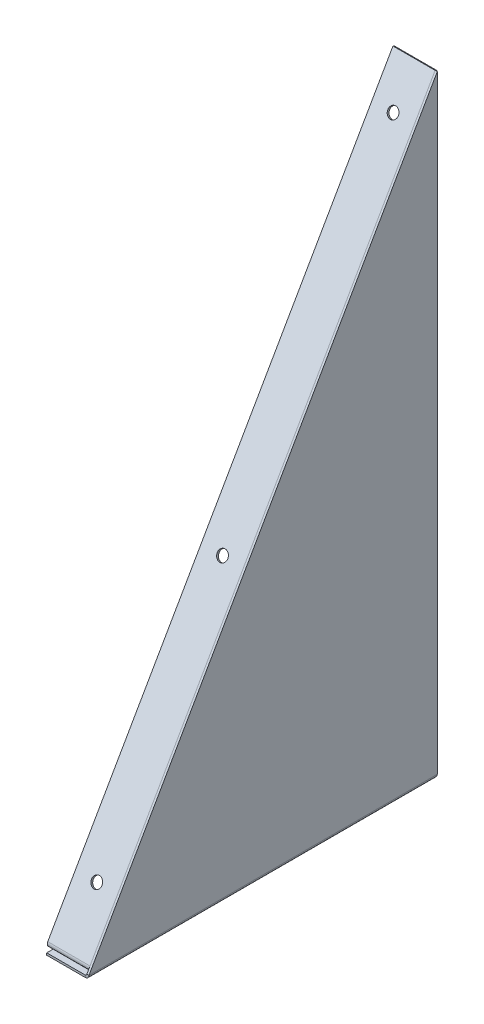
ISO-10303-21;
HEADER;
FILE_DESCRIPTION(('STEP AP214'),'2;1');
FILE_NAME('part.step','',(''),(''),'','','');
FILE_SCHEMA(('AUTOMOTIVE_DESIGN { 1 0 10303 214 1 1 1 1 }'));
ENDSEC;
DATA;
#1=APPLICATION_CONTEXT('core data for automotive mechanical design processes');
#2=APPLICATION_PROTOCOL_DEFINITION('international standard','automotive_design',2000,#1);
#3=PRODUCT_CONTEXT('',#1,'mechanical');
#4=PRODUCT('Part','Part','',(#3));
#5=PRODUCT_RELATED_PRODUCT_CATEGORY('part','',(#4));
#6=PRODUCT_DEFINITION_FORMATION('','',#4);
#7=PRODUCT_DEFINITION_CONTEXT('part definition',#1,'design');
#8=PRODUCT_DEFINITION('design','',#6,#7);
#9=PRODUCT_DEFINITION_SHAPE('','',#8);
#10=(LENGTH_UNIT() NAMED_UNIT(*) SI_UNIT(.MILLI.,.METRE.));
#11=(NAMED_UNIT(*) PLANE_ANGLE_UNIT() SI_UNIT($,.RADIAN.));
#12=(NAMED_UNIT(*) SI_UNIT($,.STERADIAN.) SOLID_ANGLE_UNIT());
#13=UNCERTAINTY_MEASURE_WITH_UNIT(LENGTH_MEASURE(1.E-05),#10,'distance_accuracy_value','');
#14=(GEOMETRIC_REPRESENTATION_CONTEXT(3) GLOBAL_UNCERTAINTY_ASSIGNED_CONTEXT((#13)) GLOBAL_UNIT_ASSIGNED_CONTEXT((#10,
#11,#12)) REPRESENTATION_CONTEXT('',''));
#15=CARTESIAN_POINT('',(0.,0.,0.));
#16=DIRECTION('',(0.,0.,1.));
#17=DIRECTION('',(1.,0.,0.));
#18=AXIS2_PLACEMENT_3D('',#15,#16,#17);
#19=CARTESIAN_POINT('',(-21.,1.7366,162.005019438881));
#20=DIRECTION('',(-1.,0.,0.));
#21=DIRECTION('',(0.,0.,1.));
#22=AXIS2_PLACEMENT_3D('',#19,#20,#21);
#23=PLANE('',#22);
#24=DIRECTION('',(0.,1.,0.));
#25=VECTOR('',#24,1.);
#26=CARTESIAN_POINT('',(-21.,1.7366,162.005019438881));
#27=LINE('',#26,#25);
#28=CARTESIAN_POINT('',(-21.,1.7366,162.005019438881));
#29=VERTEX_POINT('',#28);
#30=CARTESIAN_POINT('',(-21.,2.7366,162.005019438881));
#31=VERTEX_POINT('',#30);
#32=EDGE_CURVE('E12',#29,#31,#27,.T.);
#33=ORIENTED_EDGE('',*,*,#32,.F.);
#34=CARTESIAN_POINT('',(-21.,3.4732,162.005019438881));
#35=DIRECTION('',(-1.,0.,0.));
#36=DIRECTION('',(0.,0.,1.));
#37=AXIS2_PLACEMENT_3D('',#34,#35,#36);
#38=CIRCLE('',#37,1.7366);
#39=CARTESIAN_POINT('',(-21.,4.33589059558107,163.512183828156));
#40=VERTEX_POINT('',#39);
#41=EDGE_CURVE('E160',#40,#29,#38,.F.);
#42=ORIENTED_EDGE('',*,*,#41,.F.);
#43=DIRECTION('',(0.,0.496769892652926,0.867882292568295));
#44=VECTOR('',#43,1.);
#45=CARTESIAN_POINT('',(-21.,3.83912070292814,162.644301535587));
#46=LINE('',#45,#44);
#47=CARTESIAN_POINT('',(-21.,3.83912070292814,162.644301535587));
#48=VERTEX_POINT('',#47);
#49=EDGE_CURVE('E70',#48,#40,#46,.T.);
#50=ORIENTED_EDGE('',*,*,#49,.F.);
#51=CARTESIAN_POINT('',(-21.,3.4732,162.005019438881));
#52=DIRECTION('',(-1.,0.,0.));
#53=DIRECTION('',(0.,0.,1.));
#54=AXIS2_PLACEMENT_3D('',#51,#52,#53);
#55=CIRCLE('',#54,0.7366);
#56=EDGE_CURVE('E153',#48,#31,#55,.F.);
#57=ORIENTED_EDGE('',*,*,#56,.T.);
#58=EDGE_LOOP('',(#33,#42,#50,#57));
#59=FACE_BOUND('',#58,.T.);
#60=ADVANCED_FACE('F61',(#59),#23,.T.);
#61=CARTESIAN_POINT('',(-21.,3.83912070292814,162.644301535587));
#62=DIRECTION('',(-1.,0.,0.));
#63=DIRECTION('',(0.,0.,1.));
#64=AXIS2_PLACEMENT_3D('',#61,#62,#63);
#65=PLANE('',#64);
#66=DIRECTION('',(0.,0.,-1.));
#67=VECTOR('',#66,1.);
#68=CARTESIAN_POINT('',(-21.,1.7366,165.));
#69=LINE('',#68,#67);
#70=CARTESIAN_POINT('',(-21.,1.7366,145.));
#71=VERTEX_POINT('',#70);
#72=EDGE_CURVE('E239',#29,#71,#69,.T.);
#73=ORIENTED_EDGE('',*,*,#72,.F.);
#74=ORIENTED_EDGE('',*,*,#32,.T.);
#75=DIRECTION('',(0.,0.,1.));
#76=VECTOR('',#75,1.);
#77=CARTESIAN_POINT('',(-21.,2.7366,165.));
#78=LINE('',#77,#76);
#79=CARTESIAN_POINT('',(-21.,2.7366,145.));
#80=VERTEX_POINT('',#79);
#81=EDGE_CURVE('E119',#31,#80,#78,.F.);
#82=ORIENTED_EDGE('',*,*,#81,.T.);
#83=DIRECTION('',(0.,1.,0.));
#84=VECTOR('',#83,1.);
#85=CARTESIAN_POINT('',(-21.,1.7366,145.));
#86=LINE('',#85,#84);
#87=EDGE_CURVE('E243',#71,#80,#86,.T.);
#88=ORIENTED_EDGE('',*,*,#87,.F.);
#89=EDGE_LOOP('',(#73,#74,#82,#88));
#90=FACE_BOUND('',#89,.T.);
#91=ADVANCED_FACE('F225',(#90),#65,.T.);
#92=CARTESIAN_POINT('',(-1.,4.33589059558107,163.512183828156));
#93=DIRECTION('',(1.,0.,0.));
#94=DIRECTION('',(0.,0.,-1.));
#95=AXIS2_PLACEMENT_3D('',#92,#93,#94);
#96=PLANE('',#95);
#97=DIRECTION('',(0.,-0.496769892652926,-0.867882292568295));
#98=VECTOR('',#97,1.);
#99=CARTESIAN_POINT('',(-1.,4.33589059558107,163.512183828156));
#100=LINE('',#99,#98);
#101=CARTESIAN_POINT('',(-1.,4.33589059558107,163.512183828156));
#102=VERTEX_POINT('',#101);
#103=CARTESIAN_POINT('',(-1.,3.83912070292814,162.644301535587));
#104=VERTEX_POINT('',#103);
#105=EDGE_CURVE('E106',#102,#104,#100,.T.);
#106=ORIENTED_EDGE('',*,*,#105,.F.);
#107=CARTESIAN_POINT('',(-1.,3.4732,162.005019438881));
#108=DIRECTION('',(-1.,0.,0.));
#109=DIRECTION('',(0.,0.,1.));
#110=AXIS2_PLACEMENT_3D('',#107,#108,#109);
#111=CIRCLE('',#110,1.7366);
#112=CARTESIAN_POINT('',(-1.,1.7366,162.005019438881));
#113=VERTEX_POINT('',#112);
#114=EDGE_CURVE('E175',#102,#113,#111,.F.);
#115=ORIENTED_EDGE('',*,*,#114,.T.);
#116=DIRECTION('',(0.,-1.,0.));
#117=VECTOR('',#116,1.);
#118=CARTESIAN_POINT('',(-1.,2.7366,162.005019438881));
#119=LINE('',#118,#117);
#120=CARTESIAN_POINT('',(-1.,2.7366,162.005019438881));
#121=VERTEX_POINT('',#120);
#122=EDGE_CURVE('E113',#121,#113,#119,.T.);
#123=ORIENTED_EDGE('',*,*,#122,.F.);
#124=CARTESIAN_POINT('',(-1.,3.4732,162.005019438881));
#125=DIRECTION('',(-1.,0.,0.));
#126=DIRECTION('',(0.,0.,1.));
#127=AXIS2_PLACEMENT_3D('',#124,#125,#126);
#128=CIRCLE('',#127,0.7366);
#129=EDGE_CURVE('E182',#104,#121,#128,.F.);
#130=ORIENTED_EDGE('',*,*,#129,.F.);
#131=EDGE_LOOP('',(#106,#115,#123,#130));
#132=FACE_BOUND('',#131,.T.);
#133=ADVANCED_FACE('F230',(#132),#96,.T.);
#134=CARTESIAN_POINT('',(-1.,2.7366,162.005019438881));
#135=DIRECTION('',(1.,0.,0.));
#136=DIRECTION('',(0.,0.,-1.));
#137=AXIS2_PLACEMENT_3D('',#134,#135,#136);
#138=PLANE('',#137);
#139=DIRECTION('',(0.,-0.867882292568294,0.496769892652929));
#140=VECTOR('',#139,1.);
#141=CARTESIAN_POINT('',(-1.,1.7366,165.));
#142=LINE('',#141,#140);
#143=CARTESIAN_POINT('',(-1.,290.,0.));
#144=VERTEX_POINT('',#143);
#145=EDGE_CURVE('E177',#144,#102,#142,.T.);
#146=ORIENTED_EDGE('',*,*,#145,.T.);
#147=ORIENTED_EDGE('',*,*,#105,.T.);
#148=DIRECTION('',(0.,-0.867882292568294,0.496769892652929));
#149=VECTOR('',#148,1.);
#150=CARTESIAN_POINT('',(-1.,1.23983010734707,164.132117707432));
#151=LINE('',#150,#149);
#152=CARTESIAN_POINT('',(-1.,289.503230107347,-0.867882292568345));
#153=VERTEX_POINT('',#152);
#154=EDGE_CURVE('E180',#153,#104,#151,.T.);
#155=ORIENTED_EDGE('',*,*,#154,.F.);
#156=DIRECTION('',(0.,0.496769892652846,0.867882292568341));
#157=VECTOR('',#156,1.);
#158=CARTESIAN_POINT('',(-1.,289.503230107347,-0.867882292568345));
#159=LINE('',#158,#157);
#160=EDGE_CURVE('E141',#153,#144,#159,.T.);
#161=ORIENTED_EDGE('',*,*,#160,.T.);
#162=EDGE_LOOP('',(#146,#147,#155,#161));
#163=FACE_BOUND('',#162,.T.);
#164=ADVANCED_FACE('F267',(#163),#138,.T.);
#165=CARTESIAN_POINT('',(-21.,2.7366,165.));
#166=DIRECTION('',(0.,-1.,0.));
#167=DIRECTION('',(0.,0.,-1.));
#168=AXIS2_PLACEMENT_3D('',#165,#166,#167);
#169=PLANE('',#168);
#170=DIRECTION('',(0.,0.,1.));
#171=VECTOR('',#170,1.);
#172=CARTESIAN_POINT('',(-1.,2.7366,165.));
#173=LINE('',#172,#171);
#174=CARTESIAN_POINT('',(-1.,2.7366,145.));
#175=VERTEX_POINT('',#174);
#176=EDGE_CURVE('E166',#121,#175,#173,.F.);
#177=ORIENTED_EDGE('',*,*,#176,.T.);
#178=DIRECTION('',(1.,0.,0.));
#179=VECTOR('',#178,1.);
#180=CARTESIAN_POINT('',(-21.,2.7366,145.));
#181=LINE('',#180,#179);
#182=EDGE_CURVE('E196',#80,#175,#181,.T.);
#183=ORIENTED_EDGE('',*,*,#182,.F.);
#184=ORIENTED_EDGE('',*,*,#81,.F.);
#185=DIRECTION('',(1.,0.,0.));
#186=VECTOR('',#185,1.);
#187=CARTESIAN_POINT('',(-21.,2.7366,162.005019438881));
#188=LINE('',#187,#186);
#189=EDGE_CURVE('E165',#31,#121,#188,.T.);
#190=ORIENTED_EDGE('',*,*,#189,.T.);
#191=EDGE_LOOP('',(#177,#183,#184,#190));
#192=FACE_BOUND('',#191,.T.);
#193=ADVANCED_FACE('F275',(#192),#169,.F.);
#194=CARTESIAN_POINT('',(-21.,1.7366,145.));
#195=DIRECTION('',(0.,0.,-1.));
#196=DIRECTION('',(-1.,0.,0.));
#197=AXIS2_PLACEMENT_3D('',#194,#195,#196);
#198=PLANE('',#197);
#199=DIRECTION('',(0.,1.,0.));
#200=VECTOR('',#199,1.);
#201=CARTESIAN_POINT('',(-1.,1.7366,145.));
#202=LINE('',#201,#200);
#203=CARTESIAN_POINT('',(-1.,1.7366,145.));
#204=VERTEX_POINT('',#203);
#205=EDGE_CURVE('E169',#204,#175,#202,.T.);
#206=ORIENTED_EDGE('',*,*,#205,.F.);
#207=DIRECTION('',(1.,0.,0.));
#208=VECTOR('',#207,1.);
#209=CARTESIAN_POINT('',(-21.,1.7366,145.));
#210=LINE('',#209,#208);
#211=EDGE_CURVE('E194',#71,#204,#210,.T.);
#212=ORIENTED_EDGE('',*,*,#211,.F.);
#213=ORIENTED_EDGE('',*,*,#87,.T.);
#214=ORIENTED_EDGE('',*,*,#182,.T.);
#215=EDGE_LOOP('',(#206,#212,#213,#214));
#216=FACE_BOUND('',#215,.T.);
#217=ADVANCED_FACE('F280',(#216),#198,.T.);
#218=CARTESIAN_POINT('',(-21.,1.7366,165.));
#219=DIRECTION('',(0.,-1.,0.));
#220=DIRECTION('',(0.,0.,-1.));
#221=AXIS2_PLACEMENT_3D('',#218,#219,#220);
#222=PLANE('',#221);
#223=DIRECTION('',(0.,0.,-1.));
#224=VECTOR('',#223,1.);
#225=CARTESIAN_POINT('',(-1.,1.7366,165.));
#226=LINE('',#225,#224);
#227=EDGE_CURVE('E172',#113,#204,#226,.T.);
#228=ORIENTED_EDGE('',*,*,#227,.F.);
#229=DIRECTION('',(1.,0.,0.));
#230=VECTOR('',#229,1.);
#231=CARTESIAN_POINT('',(-21.,1.7366,162.005019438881));
#232=LINE('',#231,#230);
#233=EDGE_CURVE('E191',#29,#113,#232,.T.);
#234=ORIENTED_EDGE('',*,*,#233,.F.);
#235=ORIENTED_EDGE('',*,*,#72,.T.);
#236=ORIENTED_EDGE('',*,*,#211,.T.);
#237=EDGE_LOOP('',(#228,#234,#235,#236));
#238=FACE_BOUND('',#237,.T.);
#239=ADVANCED_FACE('F238',(#238),#222,.T.);
#240=CARTESIAN_POINT('',(-21.,3.4732,162.005019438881));
#241=DIRECTION('',(1.,0.,0.));
#242=DIRECTION('',(0.,0.,-1.));
#243=AXIS2_PLACEMENT_3D('',#240,#241,#242);
#244=CYLINDRICAL_SURFACE('',#243,1.7366);
#245=ORIENTED_EDGE('',*,*,#114,.F.);
#246=DIRECTION('',(1.,0.,0.));
#247=VECTOR('',#246,1.);
#248=CARTESIAN_POINT('',(-21.,4.33589059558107,163.512183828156));
#249=LINE('',#248,#247);
#250=EDGE_CURVE('E188',#40,#102,#249,.T.);
#251=ORIENTED_EDGE('',*,*,#250,.F.);
#252=ORIENTED_EDGE('',*,*,#41,.T.);
#253=ORIENTED_EDGE('',*,*,#233,.T.);
#254=EDGE_LOOP('',(#245,#251,#252,#253));
#255=FACE_BOUND('',#254,.T.);
#256=ADVANCED_FACE('F246',(#255),#244,.T.);
#257=CARTESIAN_POINT('',(-21.,1.7366,165.));
#258=DIRECTION('',(0.,0.496769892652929,0.867882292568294));
#259=DIRECTION('',(0.,-0.867882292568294,0.496769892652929));
#260=AXIS2_PLACEMENT_3D('',#257,#258,#259);
#261=PLANE('',#260);
#262=CARTESIAN_POINT('',(-10.9920849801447,272.642354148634,9.93539785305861));
#263=DIRECTION('',(0.,0.496769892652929,0.867882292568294));
#264=DIRECTION('',(0.,-0.867882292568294,0.496769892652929));
#265=AXIS2_PLACEMENT_3D('',#262,#263,#264);
#266=CIRCLE('',#265,2.5);
#267=CARTESIAN_POINT('',(-10.9920849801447,270.472648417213,11.1773225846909));
#268=VERTEX_POINT('',#267);
#269=EDGE_CURVE('E204',#268,#268,#266,.T.);
#270=ORIENTED_EDGE('',*,*,#269,.F.);
#271=EDGE_LOOP('',(#270));
#272=FACE_BOUND('',#271,.T.);
#273=CARTESIAN_POINT('',(-10.9276626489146,131.364122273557,90.8020922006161));
#274=DIRECTION('',(0.,0.496769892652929,0.867882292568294));
#275=DIRECTION('',(0.,-0.867882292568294,0.496769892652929));
#276=AXIS2_PLACEMENT_3D('',#273,#274,#275);
#277=CIRCLE('',#276,2.5);
#278=CARTESIAN_POINT('',(-10.9276626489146,129.194416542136,92.0440169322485));
#279=VERTEX_POINT('',#278);
#280=EDGE_CURVE('E253',#279,#279,#277,.T.);
#281=ORIENTED_EDGE('',*,*,#280,.F.);
#282=EDGE_LOOP('',(#281));
#283=FACE_BOUND('',#282,.T.);
#284=CARTESIAN_POINT('',(-10.8801725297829,27.2182471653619,150.414479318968));
#285=DIRECTION('',(0.,0.496769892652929,0.867882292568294));
#286=DIRECTION('',(0.,-0.867882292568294,0.496769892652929));
#287=AXIS2_PLACEMENT_3D('',#284,#285,#286);
#288=CIRCLE('',#287,2.5);
#289=CARTESIAN_POINT('',(-10.8801725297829,25.0485414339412,151.6564040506));
#290=VERTEX_POINT('',#289);
#291=EDGE_CURVE('E250',#290,#290,#288,.T.);
#292=ORIENTED_EDGE('',*,*,#291,.F.);
#293=EDGE_LOOP('',(#292));
#294=FACE_BOUND('',#293,.T.);
#295=ORIENTED_EDGE('',*,*,#145,.F.);
#296=DIRECTION('',(1.,0.,0.));
#297=VECTOR('',#296,1.);
#298=CARTESIAN_POINT('',(-21.,290.,0.));
#299=LINE('',#298,#297);
#300=CARTESIAN_POINT('',(-21.,290.,0.));
#301=VERTEX_POINT('',#300);
#302=EDGE_CURVE('E143',#301,#144,#299,.T.);
#303=ORIENTED_EDGE('',*,*,#302,.F.);
#304=DIRECTION('',(0.,-0.867882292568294,0.496769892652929));
#305=VECTOR('',#304,1.);
#306=CARTESIAN_POINT('',(-21.,1.7366,165.));
#307=LINE('',#306,#305);
#308=EDGE_CURVE('E158',#301,#40,#307,.T.);
#309=ORIENTED_EDGE('',*,*,#308,.T.);
#310=ORIENTED_EDGE('',*,*,#250,.T.);
#311=EDGE_LOOP('',(#295,#303,#309,#310));
#312=FACE_BOUND('',#311,.T.);
#313=ADVANCED_FACE('F258',(#272,#283,#294,#312),#261,.T.);
#314=CARTESIAN_POINT('',(-21.,289.503230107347,-0.867882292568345));
#315=DIRECTION('',(0.,0.867882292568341,-0.496769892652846));
#316=DIRECTION('',(0.,0.496769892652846,0.867882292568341));
#317=AXIS2_PLACEMENT_3D('',#314,#315,#316);
#318=PLANE('',#317);
#319=ORIENTED_EDGE('',*,*,#160,.F.);
#320=DIRECTION('',(1.,0.,0.));
#321=VECTOR('',#320,1.);
#322=CARTESIAN_POINT('',(-21.,289.503230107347,-0.867882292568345));
#323=LINE('',#322,#321);
#324=CARTESIAN_POINT('',(-21.,289.503230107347,-0.867882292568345));
#325=VERTEX_POINT('',#324);
#326=EDGE_CURVE('E135',#325,#153,#323,.T.);
#327=ORIENTED_EDGE('',*,*,#326,.F.);
#328=DIRECTION('',(0.,0.496769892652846,0.867882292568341));
#329=VECTOR('',#328,1.);
#330=CARTESIAN_POINT('',(-21.,289.503230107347,-0.867882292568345));
#331=LINE('',#330,#329);
#332=EDGE_CURVE('E139',#325,#301,#331,.T.);
#333=ORIENTED_EDGE('',*,*,#332,.T.);
#334=ORIENTED_EDGE('',*,*,#302,.T.);
#335=EDGE_LOOP('',(#319,#327,#333,#334));
#336=FACE_BOUND('',#335,.T.);
#337=ADVANCED_FACE('F137',(#336),#318,.T.);
#338=CARTESIAN_POINT('',(-21.,1.23983010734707,164.132117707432));
#339=DIRECTION('',(0.,0.496769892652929,0.867882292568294));
#340=DIRECTION('',(0.,-0.867882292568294,0.496769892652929));
#341=AXIS2_PLACEMENT_3D('',#338,#339,#340);
#342=PLANE('',#341);
#343=CARTESIAN_POINT('',(-10.9920849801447,272.145584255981,9.0675155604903));
#344=DIRECTION('',(0.,0.496769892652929,0.867882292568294));
#345=DIRECTION('',(0.,-0.867882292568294,0.496769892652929));
#346=AXIS2_PLACEMENT_3D('',#343,#344,#345);
#347=CIRCLE('',#346,2.5);
#348=CARTESIAN_POINT('',(-10.9920849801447,269.97587852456,10.3094402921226));
#349=VERTEX_POINT('',#348);
#350=EDGE_CURVE('E64',#349,#349,#347,.T.);
#351=ORIENTED_EDGE('',*,*,#350,.T.);
#352=EDGE_LOOP('',(#351));
#353=FACE_BOUND('',#352,.T.);
#354=CARTESIAN_POINT('',(-10.9276626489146,130.867352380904,89.9342099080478));
#355=DIRECTION('',(0.,0.496769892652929,0.867882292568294));
#356=DIRECTION('',(0.,-0.867882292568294,0.496769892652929));
#357=AXIS2_PLACEMENT_3D('',#354,#355,#356);
#358=CIRCLE('',#357,2.5);
#359=CARTESIAN_POINT('',(-10.9276626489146,128.697646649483,91.1761346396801));
#360=VERTEX_POINT('',#359);
#361=EDGE_CURVE('E203',#360,#360,#358,.T.);
#362=ORIENTED_EDGE('',*,*,#361,.T.);
#363=EDGE_LOOP('',(#362));
#364=FACE_BOUND('',#363,.T.);
#365=CARTESIAN_POINT('',(-10.8801725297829,26.721477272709,149.546597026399));
#366=DIRECTION('',(0.,0.496769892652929,0.867882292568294));
#367=DIRECTION('',(0.,-0.867882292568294,0.496769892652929));
#368=AXIS2_PLACEMENT_3D('',#365,#366,#367);
#369=CIRCLE('',#368,2.5);
#370=CARTESIAN_POINT('',(-10.8801725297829,24.5517715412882,150.788521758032));
#371=VERTEX_POINT('',#370);
#372=EDGE_CURVE('E201',#371,#371,#369,.T.);
#373=ORIENTED_EDGE('',*,*,#372,.T.);
#374=EDGE_LOOP('',(#373));
#375=FACE_BOUND('',#374,.T.);
#376=ORIENTED_EDGE('',*,*,#154,.T.);
#377=DIRECTION('',(1.,0.,0.));
#378=VECTOR('',#377,1.);
#379=CARTESIAN_POINT('',(-21.,3.83912070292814,162.644301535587));
#380=LINE('',#379,#378);
#381=EDGE_CURVE('E144',#48,#104,#380,.T.);
#382=ORIENTED_EDGE('',*,*,#381,.F.);
#383=DIRECTION('',(0.,-0.867882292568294,0.496769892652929));
#384=VECTOR('',#383,1.);
#385=CARTESIAN_POINT('',(-21.,1.23983010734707,164.132117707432));
#386=LINE('',#385,#384);
#387=EDGE_CURVE('E148',#325,#48,#386,.T.);
#388=ORIENTED_EDGE('',*,*,#387,.F.);
#389=ORIENTED_EDGE('',*,*,#326,.T.);
#390=EDGE_LOOP('',(#376,#382,#388,#389));
#391=FACE_BOUND('',#390,.T.);
#392=ADVANCED_FACE('F149',(#353,#364,#375,#391),#342,.F.);
#393=CARTESIAN_POINT('',(-21.,3.4732,162.005019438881));
#394=DIRECTION('',(1.,0.,0.));
#395=DIRECTION('',(0.,0.,-1.));
#396=AXIS2_PLACEMENT_3D('',#393,#394,#395);
#397=CYLINDRICAL_SURFACE('',#396,0.7366);
#398=ORIENTED_EDGE('',*,*,#129,.T.);
#399=ORIENTED_EDGE('',*,*,#189,.F.);
#400=ORIENTED_EDGE('',*,*,#56,.F.);
#401=ORIENTED_EDGE('',*,*,#381,.T.);
#402=EDGE_LOOP('',(#398,#399,#400,#401));
#403=FACE_BOUND('',#402,.T.);
#404=ADVANCED_FACE('F269',(#403),#397,.F.);
#405=CARTESIAN_POINT('',(-21.,3.4732,162.005019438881));
#406=DIRECTION('',(-1.,0.,0.));
#407=DIRECTION('',(0.,0.,1.));
#408=AXIS2_PLACEMENT_3D('',#405,#406,#407);
#409=PLANE('',#408);
#410=ORIENTED_EDGE('',*,*,#387,.T.);
#411=ORIENTED_EDGE('',*,*,#49,.T.);
#412=ORIENTED_EDGE('',*,*,#308,.F.);
#413=ORIENTED_EDGE('',*,*,#332,.F.);
#414=EDGE_LOOP('',(#410,#411,#412,#413));
#415=FACE_BOUND('',#414,.T.);
#416=ADVANCED_FACE('F156',(#415),#409,.T.);
#417=CARTESIAN_POINT('',(-1.,3.4732,162.005019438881));
#418=DIRECTION('',(-1.,0.,0.));
#419=DIRECTION('',(0.,0.,1.));
#420=AXIS2_PLACEMENT_3D('',#417,#418,#419);
#421=PLANE('',#420);
#422=ORIENTED_EDGE('',*,*,#176,.F.);
#423=ORIENTED_EDGE('',*,*,#122,.T.);
#424=ORIENTED_EDGE('',*,*,#227,.T.);
#425=ORIENTED_EDGE('',*,*,#205,.T.);
#426=EDGE_LOOP('',(#422,#423,#424,#425));
#427=FACE_BOUND('',#426,.T.);
#428=ADVANCED_FACE('F295',(#427),#421,.F.);
#429=CARTESIAN_POINT('',(-10.8801725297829,22.2505482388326,141.735656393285));
#430=DIRECTION('',(0.,0.496769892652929,0.867882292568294));
#431=DIRECTION('',(0.,-0.867882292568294,0.496769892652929));
#432=AXIS2_PLACEMENT_3D('',#429,#430,#431);
#433=CYLINDRICAL_SURFACE('',#432,2.5);
#434=ORIENTED_EDGE('',*,*,#291,.T.);
#435=EDGE_LOOP('',(#434));
#436=FACE_BOUND('',#435,.T.);
#437=ORIENTED_EDGE('',*,*,#372,.F.);
#438=EDGE_LOOP('',(#437));
#439=FACE_BOUND('',#438,.T.);
#440=ADVANCED_FACE('F220',(#436,#439),#433,.F.);
#441=CARTESIAN_POINT('',(-10.9276626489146,126.396423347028,82.1232692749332));
#442=DIRECTION('',(0.,0.496769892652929,0.867882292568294));
#443=DIRECTION('',(0.,-0.867882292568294,0.496769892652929));
#444=AXIS2_PLACEMENT_3D('',#441,#442,#443);
#445=CYLINDRICAL_SURFACE('',#444,2.5);
#446=ORIENTED_EDGE('',*,*,#280,.T.);
#447=EDGE_LOOP('',(#446));
#448=FACE_BOUND('',#447,.T.);
#449=ORIENTED_EDGE('',*,*,#361,.F.);
#450=EDGE_LOOP('',(#449));
#451=FACE_BOUND('',#450,.T.);
#452=ADVANCED_FACE('F214',(#448,#451),#445,.F.);
#453=CARTESIAN_POINT('',(-10.9920849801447,267.674655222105,1.25657492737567));
#454=DIRECTION('',(0.,0.496769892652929,0.867882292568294));
#455=DIRECTION('',(0.,-0.867882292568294,0.496769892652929));
#456=AXIS2_PLACEMENT_3D('',#453,#454,#455);
#457=CYLINDRICAL_SURFACE('',#456,2.5);
#458=ORIENTED_EDGE('',*,*,#269,.T.);
#459=EDGE_LOOP('',(#458));
#460=FACE_BOUND('',#459,.T.);
#461=ORIENTED_EDGE('',*,*,#350,.F.);
#462=EDGE_LOOP('',(#461));
#463=FACE_BOUND('',#462,.T.);
#464=ADVANCED_FACE('F212',(#460,#463),#457,.F.);
#465=CLOSED_SHELL('',(#60,#91,#133,#164,#193,#217,#239,#256,#313,#337,#392,#404,#416,#428,#440,
#452,#464));
#466=MANIFOLD_SOLID_BREP('B2',#465);
#467=CARTESIAN_POINT('',(0.,0.,165.));
#468=DIRECTION('',(-1.,0.,0.));
#469=DIRECTION('',(0.,0.,1.));
#470=AXIS2_PLACEMENT_3D('',#467,#468,#469);
#471=PLANE('',#470);
#472=DIRECTION('',(0.,0.867882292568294,-0.496769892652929));
#473=VECTOR('',#472,1.);
#474=CARTESIAN_POINT('',(0.,0.428558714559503,165.74871389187));
#475=LINE('',#474,#473);
#476=CARTESIAN_POINT('',(0.,1.7366,165.));
#477=VERTEX_POINT('',#476);
#478=CARTESIAN_POINT('',(0.,290.,0.));
#479=VERTEX_POINT('',#478);
#480=EDGE_CURVE('E504',#477,#479,#475,.T.);
#481=ORIENTED_EDGE('',*,*,#480,.F.);
#482=DIRECTION('',(0.,0.,-1.));
#483=VECTOR('',#482,1.);
#484=CARTESIAN_POINT('',(0.,1.7366,165.));
#485=LINE('',#484,#483);
#486=CARTESIAN_POINT('',(0.,1.7366,0.));
#487=VERTEX_POINT('',#486);
#488=EDGE_CURVE('E512',#477,#487,#485,.T.);
#489=ORIENTED_EDGE('',*,*,#488,.T.);
#490=DIRECTION('',(0.,1.,0.));
#491=VECTOR('',#490,1.);
#492=CARTESIAN_POINT('',(0.,0.,0.));
#493=LINE('',#492,#491);
#494=EDGE_CURVE('E514',#487,#479,#493,.T.);
#495=ORIENTED_EDGE('',*,*,#494,.T.);
#496=EDGE_LOOP('',(#481,#489,#495));
#497=FACE_BOUND('',#496,.T.);
#498=ADVANCED_FACE('F436',(#497),#471,.F.);
#499=CARTESIAN_POINT('',(-1.,0.,165.));
#500=DIRECTION('',(-1.,0.,0.));
#501=DIRECTION('',(0.,0.,1.));
#502=AXIS2_PLACEMENT_3D('',#499,#500,#501);
#503=PLANE('',#502);
#504=DIRECTION('',(0.,0.,-1.));
#505=VECTOR('',#504,1.);
#506=CARTESIAN_POINT('',(-1.,1.7366,165.));
#507=LINE('',#506,#505);
#508=CARTESIAN_POINT('',(-1.,1.7366,165.));
#509=VERTEX_POINT('',#508);
#510=CARTESIAN_POINT('',(-1.,1.7366,0.));
#511=VERTEX_POINT('',#510);
#512=EDGE_CURVE('E538',#509,#511,#507,.T.);
#513=ORIENTED_EDGE('',*,*,#512,.F.);
#514=DIRECTION('',(0.,0.867882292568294,-0.496769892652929));
#515=VECTOR('',#514,1.);
#516=CARTESIAN_POINT('',(-1.,0.428558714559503,165.74871389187));
#517=LINE('',#516,#515);
#518=CARTESIAN_POINT('',(-1.,290.,0.));
#519=VERTEX_POINT('',#518);
#520=EDGE_CURVE('E507',#509,#519,#517,.T.);
#521=ORIENTED_EDGE('',*,*,#520,.T.);
#522=DIRECTION('',(0.,1.,0.));
#523=VECTOR('',#522,1.);
#524=CARTESIAN_POINT('',(-1.,0.,0.));
#525=LINE('',#524,#523);
#526=EDGE_CURVE('E546',#511,#519,#525,.T.);
#527=ORIENTED_EDGE('',*,*,#526,.F.);
#528=EDGE_LOOP('',(#513,#521,#527));
#529=FACE_BOUND('',#528,.T.);
#530=ADVANCED_FACE('F554',(#529),#503,.T.);
#531=CARTESIAN_POINT('',(-1.7366,0.,165.));
#532=DIRECTION('',(0.,0.,1.));
#533=DIRECTION('',(1.,0.,0.));
#534=AXIS2_PLACEMENT_3D('',#531,#532,#533);
#535=PLANE('',#534);
#536=DIRECTION('',(0.,1.,0.));
#537=VECTOR('',#536,1.);
#538=CARTESIAN_POINT('',(-1.7366,0.,165.));
#539=LINE('',#538,#537);
#540=CARTESIAN_POINT('',(-1.7366,0.,165.));
#541=VERTEX_POINT('',#540);
#542=CARTESIAN_POINT('',(-1.7366,1.,165.));
#543=VERTEX_POINT('',#542);
#544=EDGE_CURVE('E59',#541,#543,#539,.T.);
#545=ORIENTED_EDGE('',*,*,#544,.F.);
#546=CARTESIAN_POINT('',(-1.7366,1.7366,165.));
#547=DIRECTION('',(0.,0.,1.));
#548=DIRECTION('',(1.,0.,0.));
#549=AXIS2_PLACEMENT_3D('',#546,#547,#548);
#550=CIRCLE('',#549,1.7366);
#551=EDGE_CURVE('E518',#541,#477,#550,.T.);
#552=ORIENTED_EDGE('',*,*,#551,.T.);
#553=DIRECTION('',(1.,0.,0.));
#554=VECTOR('',#553,1.);
#555=CARTESIAN_POINT('',(-1.,1.7366,165.));
#556=LINE('',#555,#554);
#557=EDGE_CURVE('E445',#509,#477,#556,.T.);
#558=ORIENTED_EDGE('',*,*,#557,.F.);
#559=CARTESIAN_POINT('',(-1.7366,1.7366,165.));
#560=DIRECTION('',(0.,0.,1.));
#561=DIRECTION('',(1.,0.,0.));
#562=AXIS2_PLACEMENT_3D('',#559,#560,#561);
#563=CIRCLE('',#562,0.7366);
#564=EDGE_CURVE('E552',#543,#509,#563,.T.);
#565=ORIENTED_EDGE('',*,*,#564,.F.);
#566=EDGE_LOOP('',(#545,#552,#558,#565));
#567=FACE_BOUND('',#566,.T.);
#568=ADVANCED_FACE('F438',(#567),#535,.T.);
#569=CARTESIAN_POINT('',(-1.,1.7366,165.));
#570=DIRECTION('',(0.,0.,1.));
#571=DIRECTION('',(1.,0.,0.));
#572=AXIS2_PLACEMENT_3D('',#569,#570,#571);
#573=PLANE('',#572);
#574=DIRECTION('',(1.,0.,0.));
#575=VECTOR('',#574,1.);
#576=CARTESIAN_POINT('',(-20.,0.,165.));
#577=LINE('',#576,#575);
#578=CARTESIAN_POINT('',(-20.,0.,165.));
#579=VERTEX_POINT('',#578);
#580=EDGE_CURVE('E521',#579,#541,#577,.T.);
#581=ORIENTED_EDGE('',*,*,#580,.T.);
#582=ORIENTED_EDGE('',*,*,#544,.T.);
#583=DIRECTION('',(1.,0.,0.));
#584=VECTOR('',#583,1.);
#585=CARTESIAN_POINT('',(-20.,1.,165.));
#586=LINE('',#585,#584);
#587=CARTESIAN_POINT('',(-20.,1.,165.));
#588=VERTEX_POINT('',#587);
#589=EDGE_CURVE('E568',#588,#543,#586,.T.);
#590=ORIENTED_EDGE('',*,*,#589,.F.);
#591=DIRECTION('',(0.,1.,0.));
#592=VECTOR('',#591,1.);
#593=CARTESIAN_POINT('',(-20.,0.,165.));
#594=LINE('',#593,#592);
#595=EDGE_CURVE('E571',#579,#588,#594,.T.);
#596=ORIENTED_EDGE('',*,*,#595,.F.);
#597=EDGE_LOOP('',(#581,#582,#590,#596));
#598=FACE_BOUND('',#597,.T.);
#599=ADVANCED_FACE('F580',(#598),#573,.T.);
#600=CARTESIAN_POINT('',(0.,1.7366,0.));
#601=DIRECTION('',(0.,0.,-1.));
#602=DIRECTION('',(-1.,0.,0.));
#603=AXIS2_PLACEMENT_3D('',#600,#601,#602);
#604=PLANE('',#603);
#605=DIRECTION('',(-1.,0.,0.));
#606=VECTOR('',#605,1.);
#607=CARTESIAN_POINT('',(0.,1.7366,0.));
#608=LINE('',#607,#606);
#609=EDGE_CURVE('E485',#487,#511,#608,.T.);
#610=ORIENTED_EDGE('',*,*,#609,.F.);
#611=CARTESIAN_POINT('',(-1.7366,1.7366,0.));
#612=DIRECTION('',(0.,0.,1.));
#613=DIRECTION('',(1.,0.,0.));
#614=AXIS2_PLACEMENT_3D('',#611,#612,#613);
#615=CIRCLE('',#614,1.7366);
#616=CARTESIAN_POINT('',(-1.7366,0.,0.));
#617=VERTEX_POINT('',#616);
#618=EDGE_CURVE('E524',#617,#487,#615,.T.);
#619=ORIENTED_EDGE('',*,*,#618,.F.);
#620=DIRECTION('',(0.,-1.,0.));
#621=VECTOR('',#620,1.);
#622=CARTESIAN_POINT('',(-1.7366,1.,0.));
#623=LINE('',#622,#621);
#624=CARTESIAN_POINT('',(-1.7366,1.,0.));
#625=VERTEX_POINT('',#624);
#626=EDGE_CURVE('E478',#625,#617,#623,.T.);
#627=ORIENTED_EDGE('',*,*,#626,.F.);
#628=CARTESIAN_POINT('',(-1.7366,1.7366,0.));
#629=DIRECTION('',(0.,0.,1.));
#630=DIRECTION('',(1.,0.,0.));
#631=AXIS2_PLACEMENT_3D('',#628,#629,#630);
#632=CIRCLE('',#631,0.7366);
#633=EDGE_CURVE('E551',#625,#511,#632,.T.);
#634=ORIENTED_EDGE('',*,*,#633,.T.);
#635=EDGE_LOOP('',(#610,#619,#627,#634));
#636=FACE_BOUND('',#635,.T.);
#637=ADVANCED_FACE('F557',(#636),#604,.T.);
#638=CARTESIAN_POINT('',(-1.7366,1.,0.));
#639=DIRECTION('',(0.,0.,-1.));
#640=DIRECTION('',(-1.,0.,0.));
#641=AXIS2_PLACEMENT_3D('',#638,#639,#640);
#642=PLANE('',#641);
#643=ORIENTED_EDGE('',*,*,#494,.F.);
#644=ORIENTED_EDGE('',*,*,#609,.T.);
#645=ORIENTED_EDGE('',*,*,#526,.T.);
#646=DIRECTION('',(1.,0.,0.));
#647=VECTOR('',#646,1.);
#648=CARTESIAN_POINT('',(-1.,290.,0.));
#649=LINE('',#648,#647);
#650=EDGE_CURVE('E555',#519,#479,#649,.T.);
#651=ORIENTED_EDGE('',*,*,#650,.T.);
#652=EDGE_LOOP('',(#643,#644,#645,#651));
#653=FACE_BOUND('',#652,.T.);
#654=ADVANCED_FACE('F544',(#653),#642,.T.);
#655=CARTESIAN_POINT('',(-1.7366,1.7366,165.));
#656=DIRECTION('',(0.,0.,-1.));
#657=DIRECTION('',(-1.,0.,0.));
#658=AXIS2_PLACEMENT_3D('',#655,#656,#657);
#659=CYLINDRICAL_SURFACE('',#658,0.7366);
#660=ORIENTED_EDGE('',*,*,#633,.F.);
#661=DIRECTION('',(0.,0.,-1.));
#662=VECTOR('',#661,1.);
#663=CARTESIAN_POINT('',(-1.7366,1.,165.));
#664=LINE('',#663,#662);
#665=EDGE_CURVE('E535',#543,#625,#664,.T.);
#666=ORIENTED_EDGE('',*,*,#665,.F.);
#667=ORIENTED_EDGE('',*,*,#564,.T.);
#668=ORIENTED_EDGE('',*,*,#512,.T.);
#669=EDGE_LOOP('',(#660,#666,#667,#668));
#670=FACE_BOUND('',#669,.T.);
#671=ADVANCED_FACE('F550',(#670),#659,.F.);
#672=CARTESIAN_POINT('',(-20.,1.,165.));
#673=DIRECTION('',(0.,1.,0.));
#674=DIRECTION('',(0.,0.,1.));
#675=AXIS2_PLACEMENT_3D('',#672,#673,#674);
#676=PLANE('',#675);
#677=CARTESIAN_POINT('',(-9.99999999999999,0.999999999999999,20.));
#678=DIRECTION('',(0.,1.,0.));
#679=DIRECTION('',(0.,0.,1.));
#680=AXIS2_PLACEMENT_3D('',#677,#678,#679);
#681=CIRCLE('',#680,2.5);
#682=CARTESIAN_POINT('',(-9.99999999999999,0.999999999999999,22.5));
#683=VERTEX_POINT('',#682);
#684=EDGE_CURVE('E716',#683,#683,#681,.T.);
#685=ORIENTED_EDGE('',*,*,#684,.F.);
#686=EDGE_LOOP('',(#685));
#687=FACE_BOUND('',#686,.T.);
#688=CARTESIAN_POINT('',(-9.99999999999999,0.999999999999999,140.));
#689=DIRECTION('',(0.,1.,0.));
#690=DIRECTION('',(0.,0.,1.));
#691=AXIS2_PLACEMENT_3D('',#688,#689,#690);
#692=CIRCLE('',#691,2.5);
#693=CARTESIAN_POINT('',(-9.99999999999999,0.999999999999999,142.5));
#694=VERTEX_POINT('',#693);
#695=EDGE_CURVE('E719',#694,#694,#692,.T.);
#696=ORIENTED_EDGE('',*,*,#695,.F.);
#697=EDGE_LOOP('',(#696));
#698=FACE_BOUND('',#697,.T.);
#699=DIRECTION('',(1.,0.,0.));
#700=VECTOR('',#699,1.);
#701=CARTESIAN_POINT('',(-20.,1.,0.));
#702=LINE('',#701,#700);
#703=CARTESIAN_POINT('',(-20.,1.,0.));
#704=VERTEX_POINT('',#703);
#705=EDGE_CURVE('E558',#704,#625,#702,.T.);
#706=ORIENTED_EDGE('',*,*,#705,.F.);
#707=DIRECTION('',(0.,0.,-1.));
#708=VECTOR('',#707,1.);
#709=CARTESIAN_POINT('',(-20.,1.,165.));
#710=LINE('',#709,#708);
#711=EDGE_CURVE('E533',#588,#704,#710,.T.);
#712=ORIENTED_EDGE('',*,*,#711,.F.);
#713=ORIENTED_EDGE('',*,*,#589,.T.);
#714=ORIENTED_EDGE('',*,*,#665,.T.);
#715=EDGE_LOOP('',(#706,#712,#713,#714));
#716=FACE_BOUND('',#715,.T.);
#717=ADVANCED_FACE('F594',(#687,#698,#716),#676,.T.);
#718=CARTESIAN_POINT('',(-20.,0.,165.));
#719=DIRECTION('',(-1.,0.,0.));
#720=DIRECTION('',(0.,0.,1.));
#721=AXIS2_PLACEMENT_3D('',#718,#719,#720);
#722=PLANE('',#721);
#723=DIRECTION('',(0.,1.,0.));
#724=VECTOR('',#723,1.);
#725=CARTESIAN_POINT('',(-20.,0.,0.));
#726=LINE('',#725,#724);
#727=CARTESIAN_POINT('',(-20.,0.,0.));
#728=VERTEX_POINT('',#727);
#729=EDGE_CURVE('E560',#728,#704,#726,.T.);
#730=ORIENTED_EDGE('',*,*,#729,.F.);
#731=DIRECTION('',(0.,0.,-1.));
#732=VECTOR('',#731,1.);
#733=CARTESIAN_POINT('',(-20.,0.,165.));
#734=LINE('',#733,#732);
#735=EDGE_CURVE('E527',#579,#728,#734,.T.);
#736=ORIENTED_EDGE('',*,*,#735,.F.);
#737=ORIENTED_EDGE('',*,*,#595,.T.);
#738=ORIENTED_EDGE('',*,*,#711,.T.);
#739=EDGE_LOOP('',(#730,#736,#737,#738));
#740=FACE_BOUND('',#739,.T.);
#741=ADVANCED_FACE('F583',(#740),#722,.T.);
#742=CARTESIAN_POINT('',(-20.,0.,165.));
#743=DIRECTION('',(0.,1.,0.));
#744=DIRECTION('',(0.,0.,1.));
#745=AXIS2_PLACEMENT_3D('',#742,#743,#744);
#746=PLANE('',#745);
#747=CARTESIAN_POINT('',(-9.99999999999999,0.,20.));
#748=DIRECTION('',(0.,-1.,0.));
#749=DIRECTION('',(0.,0.,-1.));
#750=AXIS2_PLACEMENT_3D('',#747,#748,#749);
#751=CIRCLE('',#750,2.5);
#752=CARTESIAN_POINT('',(-9.99999999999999,0.,17.5));
#753=VERTEX_POINT('',#752);
#754=EDGE_CURVE('E718',#753,#753,#751,.T.);
#755=ORIENTED_EDGE('',*,*,#754,.F.);
#756=EDGE_LOOP('',(#755));
#757=FACE_BOUND('',#756,.T.);
#758=CARTESIAN_POINT('',(-9.99999999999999,0.,140.));
#759=DIRECTION('',(0.,-1.,0.));
#760=DIRECTION('',(0.,0.,-1.));
#761=AXIS2_PLACEMENT_3D('',#758,#759,#760);
#762=CIRCLE('',#761,2.5);
#763=CARTESIAN_POINT('',(-9.99999999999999,0.,137.5));
#764=VERTEX_POINT('',#763);
#765=EDGE_CURVE('E720',#764,#764,#762,.T.);
#766=ORIENTED_EDGE('',*,*,#765,.F.);
#767=EDGE_LOOP('',(#766));
#768=FACE_BOUND('',#767,.T.);
#769=DIRECTION('',(1.,0.,0.));
#770=VECTOR('',#769,1.);
#771=CARTESIAN_POINT('',(-20.,0.,0.));
#772=LINE('',#771,#770);
#773=EDGE_CURVE('E565',#728,#617,#772,.T.);
#774=ORIENTED_EDGE('',*,*,#773,.T.);
#775=DIRECTION('',(0.,0.,-1.));
#776=VECTOR('',#775,1.);
#777=CARTESIAN_POINT('',(-1.7366,0.,165.));
#778=LINE('',#777,#776);
#779=EDGE_CURVE('E525',#541,#617,#778,.T.);
#780=ORIENTED_EDGE('',*,*,#779,.F.);
#781=ORIENTED_EDGE('',*,*,#580,.F.);
#782=ORIENTED_EDGE('',*,*,#735,.T.);
#783=EDGE_LOOP('',(#774,#780,#781,#782));
#784=FACE_BOUND('',#783,.T.);
#785=ADVANCED_FACE('F581',(#757,#768,#784),#746,.F.);
#786=CARTESIAN_POINT('',(-1.7366,1.7366,165.));
#787=DIRECTION('',(0.,0.,-1.));
#788=DIRECTION('',(-1.,0.,0.));
#789=AXIS2_PLACEMENT_3D('',#786,#787,#788);
#790=CYLINDRICAL_SURFACE('',#789,1.7366);
#791=ORIENTED_EDGE('',*,*,#618,.T.);
#792=ORIENTED_EDGE('',*,*,#488,.F.);
#793=ORIENTED_EDGE('',*,*,#551,.F.);
#794=ORIENTED_EDGE('',*,*,#779,.T.);
#795=EDGE_LOOP('',(#791,#792,#793,#794));
#796=FACE_BOUND('',#795,.T.);
#797=ADVANCED_FACE('F523',(#796),#790,.T.);
#798=CARTESIAN_POINT('',(-1.7366,1.7366,0.));
#799=DIRECTION('',(0.,0.,1.));
#800=DIRECTION('',(1.,0.,0.));
#801=AXIS2_PLACEMENT_3D('',#798,#799,#800);
#802=PLANE('',#801);
#803=ORIENTED_EDGE('',*,*,#705,.T.);
#804=ORIENTED_EDGE('',*,*,#626,.T.);
#805=ORIENTED_EDGE('',*,*,#773,.F.);
#806=ORIENTED_EDGE('',*,*,#729,.T.);
#807=EDGE_LOOP('',(#803,#804,#805,#806));
#808=FACE_BOUND('',#807,.T.);
#809=ADVANCED_FACE('F591',(#808),#802,.F.);
#810=CARTESIAN_POINT('',(419.986872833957,1.7366,165.));
#811=DIRECTION('',(0.,0.496769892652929,0.867882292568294));
#812=DIRECTION('',(0.,-0.867882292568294,0.496769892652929));
#813=AXIS2_PLACEMENT_3D('',#810,#811,#812);
#814=PLANE('',#813);
#815=ORIENTED_EDGE('',*,*,#557,.T.);
#816=ORIENTED_EDGE('',*,*,#480,.T.);
#817=ORIENTED_EDGE('',*,*,#650,.F.);
#818=ORIENTED_EDGE('',*,*,#520,.F.);
#819=EDGE_LOOP('',(#815,#816,#817,#818));
#820=FACE_BOUND('',#819,.T.);
#821=ADVANCED_FACE('F503',(#820),#814,.T.);
#822=CARTESIAN_POINT('',(-9.99999999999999,10.,140.));
#823=DIRECTION('',(0.,-1.,0.));
#824=DIRECTION('',(0.,0.,-1.));
#825=AXIS2_PLACEMENT_3D('',#822,#823,#824);
#826=CYLINDRICAL_SURFACE('',#825,2.5);
#827=ORIENTED_EDGE('',*,*,#695,.T.);
#828=EDGE_LOOP('',(#827));
#829=FACE_BOUND('',#828,.T.);
#830=ORIENTED_EDGE('',*,*,#765,.T.);
#831=EDGE_LOOP('',(#830));
#832=FACE_BOUND('',#831,.T.);
#833=ADVANCED_FACE('F644',(#829,#832),#826,.F.);
#834=CARTESIAN_POINT('',(-9.99999999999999,10.,20.));
#835=DIRECTION('',(0.,-1.,0.));
#836=DIRECTION('',(0.,0.,-1.));
#837=AXIS2_PLACEMENT_3D('',#834,#835,#836);
#838=CYLINDRICAL_SURFACE('',#837,2.5);
#839=ORIENTED_EDGE('',*,*,#684,.T.);
#840=EDGE_LOOP('',(#839));
#841=FACE_BOUND('',#840,.T.);
#842=ORIENTED_EDGE('',*,*,#754,.T.);
#843=EDGE_LOOP('',(#842));
#844=FACE_BOUND('',#843,.T.);
#845=ADVANCED_FACE('F699',(#841,#844),#838,.F.);
#846=CLOSED_SHELL('',(#498,#530,#568,#599,#637,#654,#671,#717,#741,#785,#797,#809,#821,#833,#845));
#847=MANIFOLD_SOLID_BREP('B6',#846);
#848=ADVANCED_BREP_SHAPE_REPRESENTATION('',(#18,#466,#847),#14);
#849=SHAPE_DEFINITION_REPRESENTATION(#9,#848);
ENDSEC;
END-ISO-10303-21;
